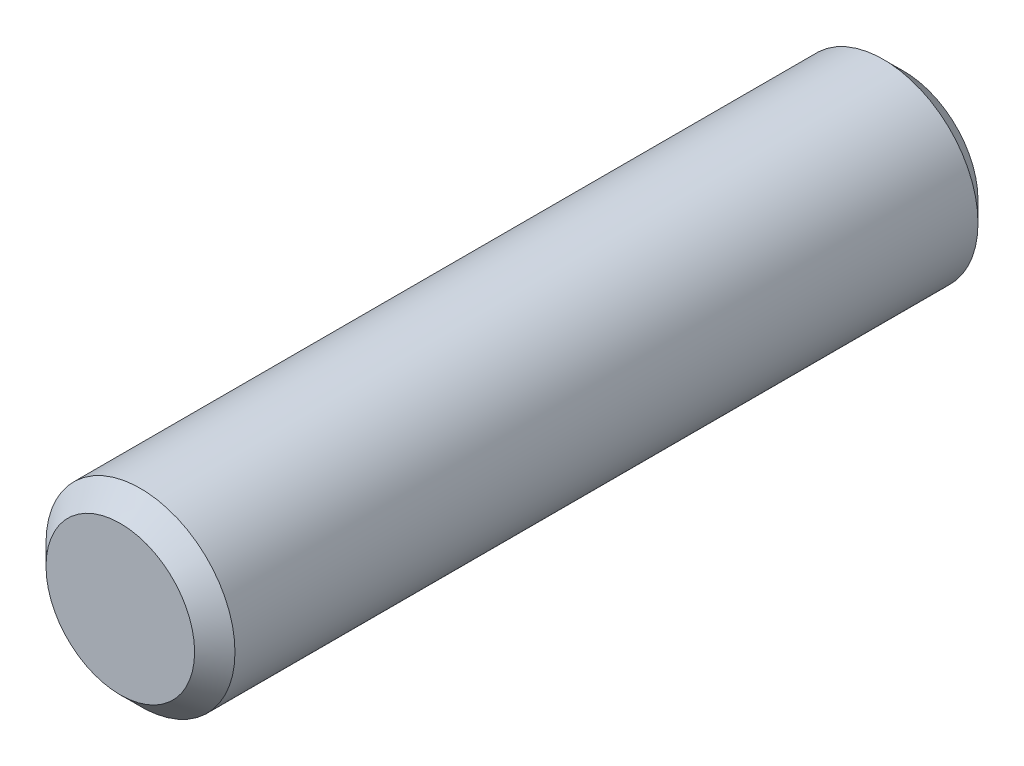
ISO-10303-21;
HEADER;
FILE_DESCRIPTION(('STEP AP214'),'2;1');
FILE_NAME('part.step','',(''),(''),'','','');
FILE_SCHEMA(('AUTOMOTIVE_DESIGN { 1 0 10303 214 1 1 1 1 }'));
ENDSEC;
DATA;
#1=APPLICATION_CONTEXT('core data for automotive mechanical design processes');
#2=APPLICATION_PROTOCOL_DEFINITION('international standard','automotive_design',2000,#1);
#3=PRODUCT_CONTEXT('',#1,'mechanical');
#4=PRODUCT('Part','Part','',(#3));
#5=PRODUCT_RELATED_PRODUCT_CATEGORY('part','',(#4));
#6=PRODUCT_DEFINITION_FORMATION('','',#4);
#7=PRODUCT_DEFINITION_CONTEXT('part definition',#1,'design');
#8=PRODUCT_DEFINITION('design','',#6,#7);
#9=PRODUCT_DEFINITION_SHAPE('','',#8);
#10=(LENGTH_UNIT() NAMED_UNIT(*) SI_UNIT(.MILLI.,.METRE.));
#11=(NAMED_UNIT(*) PLANE_ANGLE_UNIT() SI_UNIT($,.RADIAN.));
#12=(NAMED_UNIT(*) SI_UNIT($,.STERADIAN.) SOLID_ANGLE_UNIT());
#13=UNCERTAINTY_MEASURE_WITH_UNIT(LENGTH_MEASURE(1.E-05),#10,'distance_accuracy_value','');
#14=(GEOMETRIC_REPRESENTATION_CONTEXT(3) GLOBAL_UNCERTAINTY_ASSIGNED_CONTEXT((#13)) GLOBAL_UNIT_ASSIGNED_CONTEXT((#10,
#11,#12)) REPRESENTATION_CONTEXT('',''));
#15=CARTESIAN_POINT('',(0.,0.,0.));
#16=DIRECTION('',(0.,0.,1.));
#17=DIRECTION('',(1.,0.,0.));
#18=AXIS2_PLACEMENT_3D('',#15,#16,#17);
#19=CARTESIAN_POINT('',(0.,0.,12.319));
#20=DIRECTION('',(0.,0.,-1.));
#21=DIRECTION('',(-1.,0.,0.));
#22=AXIS2_PLACEMENT_3D('',#19,#20,#21);
#23=CYLINDRICAL_SURFACE('',#22,2.9718);
#24=CARTESIAN_POINT('',(0.,0.,11.684));
#25=DIRECTION('',(0.,0.,1.));
#26=DIRECTION('',(1.,0.,0.));
#27=AXIS2_PLACEMENT_3D('',#24,#25,#26);
#28=CIRCLE('',#27,2.9718);
#29=CARTESIAN_POINT('',(-2.9718,0.,11.684));
#30=VERTEX_POINT('',#29);
#31=EDGE_CURVE('E41',#30,#30,#28,.F.);
#32=CARTESIAN_POINT('',(0.,0.,-11.684));
#33=DIRECTION('',(0.,0.,1.));
#34=DIRECTION('',(1.,0.,0.));
#35=AXIS2_PLACEMENT_3D('',#32,#33,#34);
#36=CIRCLE('',#35,2.9718);
#37=CARTESIAN_POINT('',(-2.9718,0.,-11.684));
#38=VERTEX_POINT('',#37);
#39=EDGE_CURVE('E45',#38,#38,#36,.T.);
#40=CARTESIAN_POINT('',(-2.9718,0.,11.684));
#41=CARTESIAN_POINT('',(-2.9718,0.,11.4405833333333));
#42=CARTESIAN_POINT('',(-2.9718,0.,11.1971666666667));
#43=CARTESIAN_POINT('',(-2.9718,0.,10.7103333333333));
#44=CARTESIAN_POINT('',(-2.9718,0.,10.4669166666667));
#45=CARTESIAN_POINT('',(-2.9718,0.,9.98008333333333));
#46=CARTESIAN_POINT('',(-2.9718,0.,9.73666666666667));
#47=CARTESIAN_POINT('',(-2.9718,0.,9.24983333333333));
#48=CARTESIAN_POINT('',(-2.9718,0.,9.00641666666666));
#49=CARTESIAN_POINT('',(-2.9718,0.,8.51958333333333));
#50=CARTESIAN_POINT('',(-2.9718,0.,8.27616666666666));
#51=CARTESIAN_POINT('',(-2.9718,0.,7.78933333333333));
#52=CARTESIAN_POINT('',(-2.9718,0.,7.54591666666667));
#53=CARTESIAN_POINT('',(-2.9718,0.,7.05908333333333));
#54=CARTESIAN_POINT('',(-2.9718,0.,6.81566666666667));
#55=CARTESIAN_POINT('',(-2.9718,0.,6.32883333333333));
#56=CARTESIAN_POINT('',(-2.9718,0.,6.08541666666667));
#57=CARTESIAN_POINT('',(-2.9718,0.,5.59858333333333));
#58=CARTESIAN_POINT('',(-2.9718,0.,5.35516666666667));
#59=CARTESIAN_POINT('',(-2.9718,0.,4.86833333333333));
#60=CARTESIAN_POINT('',(-2.9718,0.,4.62491666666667));
#61=CARTESIAN_POINT('',(-2.9718,0.,4.13808333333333));
#62=CARTESIAN_POINT('',(-2.9718,0.,3.89466666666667));
#63=CARTESIAN_POINT('',(-2.9718,0.,3.40783333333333));
#64=CARTESIAN_POINT('',(-2.9718,0.,3.16441666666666));
#65=CARTESIAN_POINT('',(-2.9718,0.,2.67758333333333));
#66=CARTESIAN_POINT('',(-2.9718,0.,2.43416666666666));
#67=CARTESIAN_POINT('',(-2.9718,0.,1.94733333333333));
#68=CARTESIAN_POINT('',(-2.9718,0.,1.70391666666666));
#69=CARTESIAN_POINT('',(-2.9718,0.,1.21708333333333));
#70=CARTESIAN_POINT('',(-2.9718,0.,0.973666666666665));
#71=CARTESIAN_POINT('',(-2.9718,0.,0.486833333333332));
#72=CARTESIAN_POINT('',(-2.9718,0.,0.243416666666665));
#73=CARTESIAN_POINT('',(-2.9718,0.,-0.243416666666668));
#74=CARTESIAN_POINT('',(-2.9718,0.,-0.486833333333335));
#75=CARTESIAN_POINT('',(-2.9718,0.,-0.973666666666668));
#76=CARTESIAN_POINT('',(-2.9718,0.,-1.21708333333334));
#77=CARTESIAN_POINT('',(-2.9718,0.,-1.70391666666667));
#78=CARTESIAN_POINT('',(-2.9718,0.,-1.94733333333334));
#79=CARTESIAN_POINT('',(-2.9718,0.,-2.43416666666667));
#80=CARTESIAN_POINT('',(-2.9718,0.,-2.67758333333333));
#81=CARTESIAN_POINT('',(-2.9718,0.,-3.16441666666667));
#82=CARTESIAN_POINT('',(-2.9718,0.,-3.40783333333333));
#83=CARTESIAN_POINT('',(-2.9718,0.,-3.89466666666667));
#84=CARTESIAN_POINT('',(-2.9718,0.,-4.13808333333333));
#85=CARTESIAN_POINT('',(-2.9718,0.,-4.62491666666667));
#86=CARTESIAN_POINT('',(-2.9718,0.,-4.86833333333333));
#87=CARTESIAN_POINT('',(-2.9718,0.,-5.35516666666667));
#88=CARTESIAN_POINT('',(-2.9718,0.,-5.59858333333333));
#89=CARTESIAN_POINT('',(-2.9718,0.,-6.08541666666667));
#90=CARTESIAN_POINT('',(-2.9718,0.,-6.32883333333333));
#91=CARTESIAN_POINT('',(-2.9718,0.,-6.81566666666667));
#92=CARTESIAN_POINT('',(-2.9718,0.,-7.05908333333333));
#93=CARTESIAN_POINT('',(-2.9718,0.,-7.54591666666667));
#94=CARTESIAN_POINT('',(-2.9718,0.,-7.78933333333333));
#95=CARTESIAN_POINT('',(-2.9718,0.,-8.27616666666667));
#96=CARTESIAN_POINT('',(-2.9718,0.,-8.51958333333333));
#97=CARTESIAN_POINT('',(-2.9718,0.,-9.00641666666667));
#98=CARTESIAN_POINT('',(-2.9718,0.,-9.24983333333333));
#99=CARTESIAN_POINT('',(-2.9718,0.,-9.73666666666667));
#100=CARTESIAN_POINT('',(-2.9718,0.,-9.98008333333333));
#101=CARTESIAN_POINT('',(-2.9718,0.,-10.4669166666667));
#102=CARTESIAN_POINT('',(-2.9718,0.,-10.7103333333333));
#103=CARTESIAN_POINT('',(-2.9718,0.,-11.1971666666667));
#104=CARTESIAN_POINT('',(-2.9718,0.,-11.4405833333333));
#105=CARTESIAN_POINT('',(-2.9718,0.,-11.684));
#106=B_SPLINE_CURVE_WITH_KNOTS('',3,(#40,#41,#42,#43,#44,#45,#46,#47,#48,#49,#50,#51,#52,#53,
#54,#55,#56,#57,#58,#59,#60,#61,#62,#63,#64,#65,#66,#67,#68,#69,#70,#71,#72,#73,#74,#75,#76,#77,
#78,#79,#80,#81,#82,#83,#84,#85,#86,#87,#88,#89,#90,#91,#92,#93,#94,#95,#96,#97,#98,#99,#100,
#101,#102,#103,#104,#105),.UNSPECIFIED.,.F.,.F.,(4,2,2,2,2,2,2,2,2,2,2,2,2,2,2,2,2,2,2,2,2,2,2,
2,2,2,2,2,2,2,2,2,4),(0.,0.73025,1.4605,2.19075,2.921,3.65125,4.3815,5.11175,5.842,6.57225,
7.3025,8.03275,8.763,9.49325,10.2235,10.95375,11.684,12.41425,13.1445,13.87475,14.605,15.33525,
16.0655,16.79575,17.526,18.25625,18.9865,19.71675,20.447,21.17725,21.9075,22.63775,23.368),.UNSPECIFIED.);
#107=EDGE_CURVE('BSEAM34',#30,#38,#106,.T.);
#108=ORIENTED_EDGE('',*,*,#31,.T.);
#109=ORIENTED_EDGE('',*,*,#39,.T.);
#110=ORIENTED_EDGE('',*,*,#107,.T.);
#111=ORIENTED_EDGE('',*,*,#107,.F.);
#112=EDGE_LOOP('',(#108,#110,#109,#111));
#113=FACE_BOUND('',#112,.T.);
#114=ADVANCED_FACE('F34',(#113),#23,.T.);
#115=CARTESIAN_POINT('',(0.,0.,12.319));
#116=DIRECTION('',(0.,0.,1.));
#117=DIRECTION('',(1.,0.,0.));
#118=AXIS2_PLACEMENT_3D('',#115,#116,#117);
#119=PLANE('',#118);
#120=CARTESIAN_POINT('',(0.,0.,12.319));
#121=DIRECTION('',(0.,0.,1.));
#122=DIRECTION('',(1.,0.,0.));
#123=AXIS2_PLACEMENT_3D('',#120,#121,#122);
#124=CIRCLE('',#123,2.3368);
#125=CARTESIAN_POINT('',(2.3368,0.,12.319));
#126=VERTEX_POINT('',#125);
#127=EDGE_CURVE('E49',#126,#126,#124,.T.);
#128=ORIENTED_EDGE('',*,*,#127,.T.);
#129=EDGE_LOOP('',(#128));
#130=FACE_BOUND('',#129,.T.);
#131=ADVANCED_FACE('F55',(#130),#119,.T.);
#132=CARTESIAN_POINT('',(0.,0.,-12.319));
#133=DIRECTION('',(0.,0.,1.));
#134=DIRECTION('',(1.,0.,0.));
#135=AXIS2_PLACEMENT_3D('',#132,#133,#134);
#136=PLANE('',#135);
#137=CARTESIAN_POINT('',(0.,0.,-12.319));
#138=DIRECTION('',(0.,0.,1.));
#139=DIRECTION('',(1.,0.,0.));
#140=AXIS2_PLACEMENT_3D('',#137,#138,#139);
#141=CIRCLE('',#140,2.33679999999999);
#142=CARTESIAN_POINT('',(2.33679999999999,0.,-12.319));
#143=VERTEX_POINT('',#142);
#144=EDGE_CURVE('E10',#143,#143,#141,.F.);
#145=ORIENTED_EDGE('',*,*,#144,.T.);
#146=EDGE_LOOP('',(#145));
#147=FACE_BOUND('',#146,.T.);
#148=ADVANCED_FACE('F59',(#147),#136,.F.);
#149=CARTESIAN_POINT('',(0.,0.,12.319));
#150=DIRECTION('',(0.,0.,-1.));
#151=DIRECTION('',(-1.,0.,0.));
#152=AXIS2_PLACEMENT_3D('',#149,#150,#151);
#153=CONICAL_SURFACE('',#152,2.3368,0.785398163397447);
#154=ORIENTED_EDGE('',*,*,#31,.F.);
#155=EDGE_LOOP('',(#154));
#156=FACE_BOUND('',#155,.T.);
#157=ORIENTED_EDGE('',*,*,#127,.F.);
#158=EDGE_LOOP('',(#157));
#159=FACE_BOUND('',#158,.T.);
#160=ADVANCED_FACE('F57',(#156,#159),#153,.T.);
#161=CARTESIAN_POINT('',(0.,0.,-11.684));
#162=DIRECTION('',(0.,0.,1.));
#163=DIRECTION('',(1.,0.,0.));
#164=AXIS2_PLACEMENT_3D('',#161,#162,#163);
#165=CONICAL_SURFACE('',#164,2.9718,0.78539816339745);
#166=ORIENTED_EDGE('',*,*,#144,.F.);
#167=EDGE_LOOP('',(#166));
#168=FACE_BOUND('',#167,.T.);
#169=ORIENTED_EDGE('',*,*,#39,.F.);
#170=EDGE_LOOP('',(#169));
#171=FACE_BOUND('',#170,.T.);
#172=ADVANCED_FACE('F36',(#168,#171),#165,.T.);
#173=CLOSED_SHELL('',(#114,#131,#148,#160,#172));
#174=MANIFOLD_SOLID_BREP('B2',#173);
#175=ADVANCED_BREP_SHAPE_REPRESENTATION('',(#18,#174),#14);
#176=SHAPE_DEFINITION_REPRESENTATION(#9,#175);
ENDSEC;
END-ISO-10303-21;
